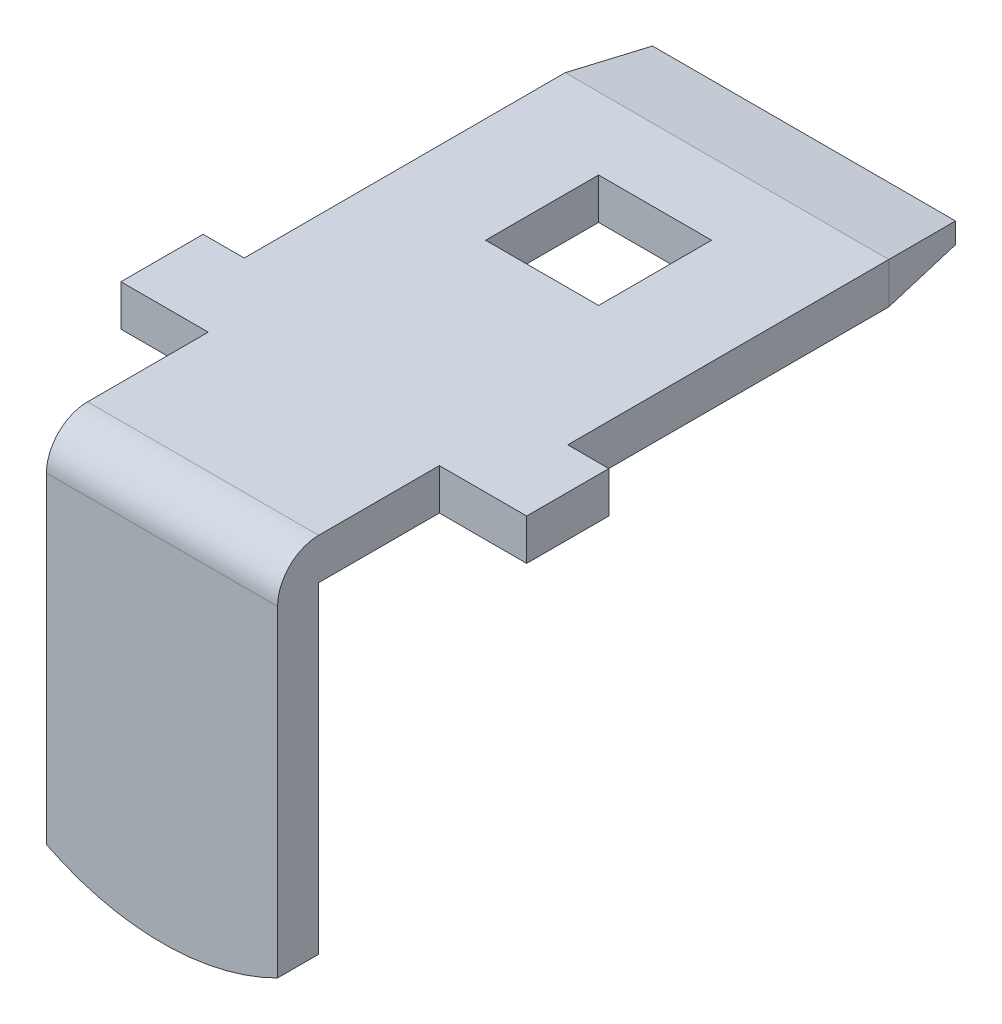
ISO-10303-21;
HEADER;
FILE_DESCRIPTION(('STEP AP214'),'2;1');
FILE_NAME('part.step','',(''),(''),'','','');
FILE_SCHEMA(('AUTOMOTIVE_DESIGN { 1 0 10303 214 1 1 1 1 }'));
ENDSEC;
DATA;
#1=APPLICATION_CONTEXT('core data for automotive mechanical design processes');
#2=APPLICATION_PROTOCOL_DEFINITION('international standard','automotive_design',2000,#1);
#3=PRODUCT_CONTEXT('',#1,'mechanical');
#4=PRODUCT('Part','Part','',(#3));
#5=PRODUCT_RELATED_PRODUCT_CATEGORY('part','',(#4));
#6=PRODUCT_DEFINITION_FORMATION('','',#4);
#7=PRODUCT_DEFINITION_CONTEXT('part definition',#1,'design');
#8=PRODUCT_DEFINITION('design','',#6,#7);
#9=PRODUCT_DEFINITION_SHAPE('','',#8);
#10=(LENGTH_UNIT() NAMED_UNIT(*) SI_UNIT(.MILLI.,.METRE.));
#11=(NAMED_UNIT(*) PLANE_ANGLE_UNIT() SI_UNIT($,.RADIAN.));
#12=(NAMED_UNIT(*) SI_UNIT($,.STERADIAN.) SOLID_ANGLE_UNIT());
#13=UNCERTAINTY_MEASURE_WITH_UNIT(LENGTH_MEASURE(1.E-05),#10,'distance_accuracy_value','');
#14=(GEOMETRIC_REPRESENTATION_CONTEXT(3) GLOBAL_UNCERTAINTY_ASSIGNED_CONTEXT((#13)) GLOBAL_UNIT_ASSIGNED_CONTEXT((#10,
#11,#12)) REPRESENTATION_CONTEXT('',''));
#15=CARTESIAN_POINT('',(0.,0.,0.));
#16=DIRECTION('',(0.,0.,1.));
#17=DIRECTION('',(1.,0.,0.));
#18=AXIS2_PLACEMENT_3D('',#15,#16,#17);
#19=CARTESIAN_POINT('',(60.,306.,-10.3000000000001));
#20=DIRECTION('',(0.,0.,-1.));
#21=DIRECTION('',(0.,1.,0.));
#22=AXIS2_PLACEMENT_3D('',#19,#20,#21);
#23=CYLINDRICAL_SURFACE('',#22,4.99999999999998);
#24=DIRECTION('',(0.,0.,-1.));
#25=VECTOR('',#24,1.);
#26=CARTESIAN_POINT('',(57.75,301.534857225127,-10.3000000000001));
#27=LINE('',#26,#25);
#28=CARTESIAN_POINT('',(57.75,301.534857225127,-10.3000000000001));
#29=VERTEX_POINT('',#28);
#30=CARTESIAN_POINT('',(57.75,301.534857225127,-11.1));
#31=VERTEX_POINT('',#30);
#32=EDGE_CURVE('E271',#29,#31,#27,.T.);
#33=ORIENTED_EDGE('',*,*,#32,.T.);
#34=CARTESIAN_POINT('',(60.,306.,-11.1));
#35=DIRECTION('',(0.,0.,-1.));
#36=DIRECTION('',(0.,1.,0.));
#37=AXIS2_PLACEMENT_3D('',#34,#35,#36);
#38=CIRCLE('',#37,4.99999999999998);
#39=CARTESIAN_POINT('',(62.25,301.534857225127,-11.1));
#40=VERTEX_POINT('',#39);
#41=EDGE_CURVE('E325',#40,#31,#38,.T.);
#42=ORIENTED_EDGE('',*,*,#41,.F.);
#43=DIRECTION('',(0.,0.,-1.));
#44=VECTOR('',#43,1.);
#45=CARTESIAN_POINT('',(62.25,301.534857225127,-10.3000000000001));
#46=LINE('',#45,#44);
#47=CARTESIAN_POINT('',(62.25,301.534857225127,-10.3000000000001));
#48=VERTEX_POINT('',#47);
#49=EDGE_CURVE('E377',#48,#40,#46,.T.);
#50=ORIENTED_EDGE('',*,*,#49,.F.);
#51=CARTESIAN_POINT('',(60.,306.,-10.3000000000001));
#52=DIRECTION('',(0.,0.,-1.));
#53=DIRECTION('',(0.,1.,0.));
#54=AXIS2_PLACEMENT_3D('',#51,#52,#53);
#55=CIRCLE('',#54,4.99999999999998);
#56=EDGE_CURVE('E307',#48,#29,#55,.T.);
#57=ORIENTED_EDGE('',*,*,#56,.T.);
#58=EDGE_LOOP('',(#33,#42,#50,#57));
#59=FACE_BOUND('',#58,.T.);
#60=ADVANCED_FACE('F34',(#59),#23,.T.);
#61=CARTESIAN_POINT('',(57.75,301.534857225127,-10.3000000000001));
#62=DIRECTION('',(-1.,0.,0.));
#63=DIRECTION('',(0.,-1.,0.));
#64=AXIS2_PLACEMENT_3D('',#61,#62,#63);
#65=PLANE('',#64);
#66=DIRECTION('',(0.,1.,0.));
#67=VECTOR('',#66,1.);
#68=CARTESIAN_POINT('',(57.75,301.534857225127,-10.3000000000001));
#69=LINE('',#68,#67);
#70=CARTESIAN_POINT('',(57.75,307.8,-10.3000000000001));
#71=VERTEX_POINT('',#70);
#72=EDGE_CURVE('E317',#29,#71,#69,.T.);
#73=ORIENTED_EDGE('',*,*,#72,.T.);
#74=CARTESIAN_POINT('',(57.75,307.8,-11.1000000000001));
#75=DIRECTION('',(-1.,0.,0.));
#76=DIRECTION('',(0.,-1.,0.));
#77=AXIS2_PLACEMENT_3D('',#74,#75,#76);
#78=CIRCLE('',#77,0.8);
#79=CARTESIAN_POINT('',(57.75,308.6,-11.1000000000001));
#80=VERTEX_POINT('',#79);
#81=EDGE_CURVE('E11',#71,#80,#78,.T.);
#82=ORIENTED_EDGE('',*,*,#81,.T.);
#83=DIRECTION('',(0.,0.,-1.));
#84=VECTOR('',#83,1.);
#85=CARTESIAN_POINT('',(57.75,308.6,-10.3000000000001));
#86=LINE('',#85,#84);
#87=CARTESIAN_POINT('',(57.75,308.6,-13.45));
#88=VERTEX_POINT('',#87);
#89=EDGE_CURVE('E303',#80,#88,#86,.T.);
#90=ORIENTED_EDGE('',*,*,#89,.T.);
#91=DIRECTION('',(0.,1.,0.));
#92=VECTOR('',#91,1.);
#93=CARTESIAN_POINT('',(57.75,308.6,-13.45));
#94=LINE('',#93,#92);
#95=CARTESIAN_POINT('',(57.75,307.8,-13.45));
#96=VERTEX_POINT('',#95);
#97=EDGE_CURVE('E242',#96,#88,#94,.T.);
#98=ORIENTED_EDGE('',*,*,#97,.F.);
#99=DIRECTION('',(0.,0.,-1.));
#100=VECTOR('',#99,1.);
#101=CARTESIAN_POINT('',(57.75,307.8,-11.1));
#102=LINE('',#101,#100);
#103=CARTESIAN_POINT('',(57.75,307.8,-11.1));
#104=VERTEX_POINT('',#103);
#105=EDGE_CURVE('E318',#104,#96,#102,.T.);
#106=ORIENTED_EDGE('',*,*,#105,.F.);
#107=DIRECTION('',(0.,1.,0.));
#108=VECTOR('',#107,1.);
#109=CARTESIAN_POINT('',(57.75,301.534857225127,-11.1));
#110=LINE('',#109,#108);
#111=EDGE_CURVE('E356',#31,#104,#110,.T.);
#112=ORIENTED_EDGE('',*,*,#111,.F.);
#113=ORIENTED_EDGE('',*,*,#32,.F.);
#114=EDGE_LOOP('',(#73,#82,#90,#98,#106,#112,#113));
#115=FACE_BOUND('',#114,.T.);
#116=ADVANCED_FACE('F374',(#115),#65,.T.);
#117=CARTESIAN_POINT('',(62.25,308.6,-10.3000000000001));
#118=DIRECTION('',(1.,0.,0.));
#119=DIRECTION('',(0.,0.,-1.));
#120=AXIS2_PLACEMENT_3D('',#117,#118,#119);
#121=PLANE('',#120);
#122=DIRECTION('',(0.,0.,-1.));
#123=VECTOR('',#122,1.);
#124=CARTESIAN_POINT('',(62.25,308.6,-10.3000000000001));
#125=LINE('',#124,#123);
#126=CARTESIAN_POINT('',(62.25,308.6,-11.1000000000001));
#127=VERTEX_POINT('',#126);
#128=CARTESIAN_POINT('',(62.25,308.6,-13.45));
#129=VERTEX_POINT('',#128);
#130=EDGE_CURVE('E306',#127,#129,#125,.T.);
#131=ORIENTED_EDGE('',*,*,#130,.F.);
#132=CARTESIAN_POINT('',(62.25,307.8,-11.1000000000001));
#133=DIRECTION('',(1.,0.,0.));
#134=DIRECTION('',(0.,0.,-1.));
#135=AXIS2_PLACEMENT_3D('',#132,#133,#134);
#136=CIRCLE('',#135,0.8);
#137=CARTESIAN_POINT('',(62.25,307.8,-10.3000000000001));
#138=VERTEX_POINT('',#137);
#139=EDGE_CURVE('E56',#127,#138,#136,.T.);
#140=ORIENTED_EDGE('',*,*,#139,.T.);
#141=DIRECTION('',(0.,-1.,0.));
#142=VECTOR('',#141,1.);
#143=CARTESIAN_POINT('',(62.25,308.6,-10.3000000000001));
#144=LINE('',#143,#142);
#145=EDGE_CURVE('E380',#138,#48,#144,.T.);
#146=ORIENTED_EDGE('',*,*,#145,.T.);
#147=ORIENTED_EDGE('',*,*,#49,.T.);
#148=DIRECTION('',(0.,-1.,0.));
#149=VECTOR('',#148,1.);
#150=CARTESIAN_POINT('',(62.25,307.8,-11.1));
#151=LINE('',#150,#149);
#152=CARTESIAN_POINT('',(62.25,307.8,-11.1));
#153=VERTEX_POINT('',#152);
#154=EDGE_CURVE('E362',#153,#40,#151,.T.);
#155=ORIENTED_EDGE('',*,*,#154,.F.);
#156=DIRECTION('',(0.,0.,-1.));
#157=VECTOR('',#156,1.);
#158=CARTESIAN_POINT('',(62.25,307.8,-11.1));
#159=LINE('',#158,#157);
#160=CARTESIAN_POINT('',(62.25,307.8,-13.45));
#161=VERTEX_POINT('',#160);
#162=EDGE_CURVE('E314',#153,#161,#159,.T.);
#163=ORIENTED_EDGE('',*,*,#162,.T.);
#164=DIRECTION('',(0.,-1.,0.));
#165=VECTOR('',#164,1.);
#166=CARTESIAN_POINT('',(62.25,307.8,-13.45));
#167=LINE('',#166,#165);
#168=EDGE_CURVE('E319',#129,#161,#167,.T.);
#169=ORIENTED_EDGE('',*,*,#168,.F.);
#170=EDGE_LOOP('',(#131,#140,#146,#147,#155,#163,#169));
#171=FACE_BOUND('',#170,.T.);
#172=ADVANCED_FACE('F387',(#171),#121,.T.);
#173=CARTESIAN_POINT('',(57.75,308.6,-10.3000000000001));
#174=DIRECTION('',(0.,1.,0.));
#175=DIRECTION('',(0.,0.,1.));
#176=AXIS2_PLACEMENT_3D('',#173,#174,#175);
#177=PLANE('',#176);
#178=DIRECTION('',(1.,0.,0.));
#179=VECTOR('',#178,1.);
#180=CARTESIAN_POINT('',(57.75,308.6,-17.7));
#181=LINE('',#180,#179);
#182=CARTESIAN_POINT('',(58.9,308.6,-17.7));
#183=VERTEX_POINT('',#182);
#184=CARTESIAN_POINT('',(61.1,308.6,-17.7));
#185=VERTEX_POINT('',#184);
#186=EDGE_CURVE('E216',#183,#185,#181,.T.);
#187=ORIENTED_EDGE('',*,*,#186,.F.);
#188=DIRECTION('',(0.,0.,1.));
#189=VECTOR('',#188,1.);
#190=CARTESIAN_POINT('',(58.9,308.6,-10.3000000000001));
#191=LINE('',#190,#189);
#192=CARTESIAN_POINT('',(58.9,308.6,-19.9));
#193=VERTEX_POINT('',#192);
#194=EDGE_CURVE('E209',#193,#183,#191,.T.);
#195=ORIENTED_EDGE('',*,*,#194,.F.);
#196=DIRECTION('',(-1.,0.,0.));
#197=VECTOR('',#196,1.);
#198=CARTESIAN_POINT('',(57.75,308.6,-19.9));
#199=LINE('',#198,#197);
#200=CARTESIAN_POINT('',(61.1,308.6,-19.9));
#201=VERTEX_POINT('',#200);
#202=EDGE_CURVE('E184',#201,#193,#199,.T.);
#203=ORIENTED_EDGE('',*,*,#202,.F.);
#204=DIRECTION('',(0.,0.,-1.));
#205=VECTOR('',#204,1.);
#206=CARTESIAN_POINT('',(61.1000000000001,308.6,-10.3000000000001));
#207=LINE('',#206,#205);
#208=EDGE_CURVE('E214',#185,#201,#207,.T.);
#209=ORIENTED_EDGE('',*,*,#208,.F.);
#210=EDGE_LOOP('',(#187,#195,#203,#209));
#211=FACE_BOUND('',#210,.T.);
#212=ORIENTED_EDGE('',*,*,#89,.F.);
#213=DIRECTION('',(1.,0.,0.));
#214=VECTOR('',#213,1.);
#215=CARTESIAN_POINT('',(62.25,308.6,-11.1000000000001));
#216=LINE('',#215,#214);
#217=EDGE_CURVE('E292',#80,#127,#216,.T.);
#218=ORIENTED_EDGE('',*,*,#217,.T.);
#219=ORIENTED_EDGE('',*,*,#130,.T.);
#220=DIRECTION('',(-1.,0.,0.));
#221=VECTOR('',#220,1.);
#222=CARTESIAN_POINT('',(63.95,308.6,-13.45));
#223=LINE('',#222,#221);
#224=CARTESIAN_POINT('',(63.95,308.6,-13.45));
#225=VERTEX_POINT('',#224);
#226=EDGE_CURVE('E360',#225,#129,#223,.T.);
#227=ORIENTED_EDGE('',*,*,#226,.F.);
#228=DIRECTION('',(0.,0.,1.));
#229=VECTOR('',#228,1.);
#230=CARTESIAN_POINT('',(63.95,308.6,-13.45));
#231=LINE('',#230,#229);
#232=CARTESIAN_POINT('',(63.95,308.6,-15.0500000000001));
#233=VERTEX_POINT('',#232);
#234=EDGE_CURVE('E254',#233,#225,#231,.T.);
#235=ORIENTED_EDGE('',*,*,#234,.F.);
#236=DIRECTION('',(1.,0.,0.));
#237=VECTOR('',#236,1.);
#238=CARTESIAN_POINT('',(57.75,308.6,-15.0500000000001));
#239=LINE('',#238,#237);
#240=CARTESIAN_POINT('',(63.15,308.6,-15.0500000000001));
#241=VERTEX_POINT('',#240);
#242=EDGE_CURVE('E238',#241,#233,#239,.T.);
#243=ORIENTED_EDGE('',*,*,#242,.F.);
#244=DIRECTION('',(0.,0.,1.));
#245=VECTOR('',#244,1.);
#246=CARTESIAN_POINT('',(63.15,308.6,-10.3000000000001));
#247=LINE('',#246,#245);
#248=CARTESIAN_POINT('',(63.15,308.6,-21.3000000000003));
#249=VERTEX_POINT('',#248);
#250=EDGE_CURVE('E240',#249,#241,#247,.T.);
#251=ORIENTED_EDGE('',*,*,#250,.F.);
#252=DIRECTION('',(-1.,0.,0.));
#253=VECTOR('',#252,1.);
#254=CARTESIAN_POINT('',(57.75,308.6,-21.3000000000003));
#255=LINE('',#254,#253);
#256=CARTESIAN_POINT('',(56.85,308.6,-21.3000000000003));
#257=VERTEX_POINT('',#256);
#258=EDGE_CURVE('E290',#249,#257,#255,.T.);
#259=ORIENTED_EDGE('',*,*,#258,.T.);
#260=DIRECTION('',(0.,0.,-1.));
#261=VECTOR('',#260,1.);
#262=CARTESIAN_POINT('',(56.85,308.6,-10.3000000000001));
#263=LINE('',#262,#261);
#264=CARTESIAN_POINT('',(56.85,308.6,-15.05));
#265=VERTEX_POINT('',#264);
#266=EDGE_CURVE('E227',#265,#257,#263,.T.);
#267=ORIENTED_EDGE('',*,*,#266,.F.);
#268=DIRECTION('',(1.,0.,0.));
#269=VECTOR('',#268,1.);
#270=CARTESIAN_POINT('',(57.7500000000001,308.6,-15.05));
#271=LINE('',#270,#269);
#272=CARTESIAN_POINT('',(56.05,308.6,-15.0500000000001));
#273=VERTEX_POINT('',#272);
#274=EDGE_CURVE('E225',#273,#265,#271,.T.);
#275=ORIENTED_EDGE('',*,*,#274,.F.);
#276=DIRECTION('',(0.,0.,-1.));
#277=VECTOR('',#276,1.);
#278=CARTESIAN_POINT('',(56.05,308.6,-22.8000000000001));
#279=LINE('',#278,#277);
#280=CARTESIAN_POINT('',(56.05,308.6,-13.45));
#281=VERTEX_POINT('',#280);
#282=EDGE_CURVE('E246',#281,#273,#279,.T.);
#283=ORIENTED_EDGE('',*,*,#282,.F.);
#284=DIRECTION('',(1.,0.,0.));
#285=VECTOR('',#284,1.);
#286=CARTESIAN_POINT('',(56.05,308.6,-13.45));
#287=LINE('',#286,#285);
#288=EDGE_CURVE('E264',#281,#88,#287,.T.);
#289=ORIENTED_EDGE('',*,*,#288,.T.);
#290=EDGE_LOOP('',(#212,#218,#219,#227,#235,#243,#251,#259,#267,#275,#283,#289));
#291=FACE_BOUND('',#290,.T.);
#292=ADVANCED_FACE('F386',(#211,#291),#177,.T.);
#293=CARTESIAN_POINT('',(60.,306.,-10.3000000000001));
#294=DIRECTION('',(0.,0.,-1.));
#295=DIRECTION('',(0.,1.,0.));
#296=AXIS2_PLACEMENT_3D('',#293,#294,#295);
#297=PLANE('',#296);
#298=ORIENTED_EDGE('',*,*,#145,.F.);
#299=DIRECTION('',(1.,0.,0.));
#300=VECTOR('',#299,1.);
#301=CARTESIAN_POINT('',(57.75,307.8,-10.3000000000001));
#302=LINE('',#301,#300);
#303=EDGE_CURVE('E42',#138,#71,#302,.F.);
#304=ORIENTED_EDGE('',*,*,#303,.T.);
#305=ORIENTED_EDGE('',*,*,#72,.F.);
#306=ORIENTED_EDGE('',*,*,#56,.F.);
#307=EDGE_LOOP('',(#298,#304,#305,#306));
#308=FACE_BOUND('',#307,.T.);
#309=ADVANCED_FACE('F438',(#308),#297,.F.);
#310=CARTESIAN_POINT('',(60.,306.,-22.8000000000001));
#311=DIRECTION('',(0.,0.,-1.));
#312=DIRECTION('',(0.,1.,0.));
#313=AXIS2_PLACEMENT_3D('',#310,#311,#312);
#314=PLANE('',#313);
#315=DIRECTION('',(0.,-1.,0.));
#316=VECTOR('',#315,1.);
#317=CARTESIAN_POINT('',(62.95,307.8,-22.8000000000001));
#318=LINE('',#317,#316);
#319=CARTESIAN_POINT('',(62.95,308.4,-22.8000000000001));
#320=VERTEX_POINT('',#319);
#321=CARTESIAN_POINT('',(62.95,308.,-22.8000000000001));
#322=VERTEX_POINT('',#321);
#323=EDGE_CURVE('E281',#320,#322,#318,.T.);
#324=ORIENTED_EDGE('',*,*,#323,.T.);
#325=DIRECTION('',(-1.,0.,0.));
#326=VECTOR('',#325,1.);
#327=CARTESIAN_POINT('',(56.85,308.,-22.8000000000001));
#328=LINE('',#327,#326);
#329=CARTESIAN_POINT('',(57.05,308.,-22.8000000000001));
#330=VERTEX_POINT('',#329);
#331=EDGE_CURVE('E283',#322,#330,#328,.T.);
#332=ORIENTED_EDGE('',*,*,#331,.T.);
#333=DIRECTION('',(0.,1.,0.));
#334=VECTOR('',#333,1.);
#335=CARTESIAN_POINT('',(57.05,308.6,-22.8000000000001));
#336=LINE('',#335,#334);
#337=CARTESIAN_POINT('',(57.05,308.4,-22.8000000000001));
#338=VERTEX_POINT('',#337);
#339=EDGE_CURVE('E279',#330,#338,#336,.T.);
#340=ORIENTED_EDGE('',*,*,#339,.T.);
#341=DIRECTION('',(1.,0.,0.));
#342=VECTOR('',#341,1.);
#343=CARTESIAN_POINT('',(60.,308.4,-22.8000000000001));
#344=LINE('',#343,#342);
#345=EDGE_CURVE('E277',#338,#320,#344,.T.);
#346=ORIENTED_EDGE('',*,*,#345,.T.);
#347=EDGE_LOOP('',(#324,#332,#340,#346));
#348=FACE_BOUND('',#347,.T.);
#349=ADVANCED_FACE('F418',(#348),#314,.T.);
#350=CARTESIAN_POINT('',(57.75,307.8,-11.1));
#351=DIRECTION('',(0.,1.,0.));
#352=DIRECTION('',(0.,0.,1.));
#353=AXIS2_PLACEMENT_3D('',#350,#351,#352);
#354=PLANE('',#353);
#355=DIRECTION('',(0.,0.,-1.));
#356=VECTOR('',#355,1.);
#357=CARTESIAN_POINT('',(58.9,307.8,-17.7));
#358=LINE('',#357,#356);
#359=CARTESIAN_POINT('',(58.9,307.8,-17.7));
#360=VERTEX_POINT('',#359);
#361=CARTESIAN_POINT('',(58.9,307.8,-19.9));
#362=VERTEX_POINT('',#361);
#363=EDGE_CURVE('E192',#360,#362,#358,.T.);
#364=ORIENTED_EDGE('',*,*,#363,.F.);
#365=DIRECTION('',(-1.,0.,0.));
#366=VECTOR('',#365,1.);
#367=CARTESIAN_POINT('',(61.1,307.8,-17.7));
#368=LINE('',#367,#366);
#369=CARTESIAN_POINT('',(61.1,307.8,-17.7));
#370=VERTEX_POINT('',#369);
#371=EDGE_CURVE('E197',#370,#360,#368,.T.);
#372=ORIENTED_EDGE('',*,*,#371,.F.);
#373=DIRECTION('',(0.,0.,1.));
#374=VECTOR('',#373,1.);
#375=CARTESIAN_POINT('',(61.1,307.8,-19.9));
#376=LINE('',#375,#374);
#377=CARTESIAN_POINT('',(61.1,307.8,-19.9));
#378=VERTEX_POINT('',#377);
#379=EDGE_CURVE('E202',#378,#370,#376,.T.);
#380=ORIENTED_EDGE('',*,*,#379,.F.);
#381=DIRECTION('',(1.,0.,0.));
#382=VECTOR('',#381,1.);
#383=CARTESIAN_POINT('',(58.9,307.8,-19.9));
#384=LINE('',#383,#382);
#385=EDGE_CURVE('E181',#362,#378,#384,.T.);
#386=ORIENTED_EDGE('',*,*,#385,.F.);
#387=EDGE_LOOP('',(#364,#372,#380,#386));
#388=FACE_BOUND('',#387,.T.);
#389=DIRECTION('',(0.,0.,1.));
#390=VECTOR('',#389,1.);
#391=CARTESIAN_POINT('',(56.85,307.8,-22.8000000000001));
#392=LINE('',#391,#390);
#393=CARTESIAN_POINT('',(56.85,307.8,-21.3000000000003));
#394=VERTEX_POINT('',#393);
#395=CARTESIAN_POINT('',(56.85,307.8,-15.05));
#396=VERTEX_POINT('',#395);
#397=EDGE_CURVE('E218',#394,#396,#392,.T.);
#398=ORIENTED_EDGE('',*,*,#397,.F.);
#399=DIRECTION('',(1.,0.,0.));
#400=VECTOR('',#399,1.);
#401=CARTESIAN_POINT('',(63.15,307.8,-21.3000000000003));
#402=LINE('',#401,#400);
#403=CARTESIAN_POINT('',(63.15,307.8,-21.3000000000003));
#404=VERTEX_POINT('',#403);
#405=EDGE_CURVE('E274',#394,#404,#402,.T.);
#406=ORIENTED_EDGE('',*,*,#405,.T.);
#407=DIRECTION('',(0.,0.,-1.));
#408=VECTOR('',#407,1.);
#409=CARTESIAN_POINT('',(63.15,307.8,-15.0500000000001));
#410=LINE('',#409,#408);
#411=CARTESIAN_POINT('',(63.15,307.8,-15.0500000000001));
#412=VERTEX_POINT('',#411);
#413=EDGE_CURVE('E233',#412,#404,#410,.T.);
#414=ORIENTED_EDGE('',*,*,#413,.F.);
#415=DIRECTION('',(-1.,0.,0.));
#416=VECTOR('',#415,1.);
#417=CARTESIAN_POINT('',(63.95,307.8,-15.0500000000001));
#418=LINE('',#417,#416);
#419=CARTESIAN_POINT('',(63.95,307.8,-15.0500000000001));
#420=VERTEX_POINT('',#419);
#421=EDGE_CURVE('E230',#420,#412,#418,.T.);
#422=ORIENTED_EDGE('',*,*,#421,.F.);
#423=DIRECTION('',(0.,0.,-1.));
#424=VECTOR('',#423,1.);
#425=CARTESIAN_POINT('',(63.95,307.8,-22.8000000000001));
#426=LINE('',#425,#424);
#427=CARTESIAN_POINT('',(63.95,307.8,-13.45));
#428=VERTEX_POINT('',#427);
#429=EDGE_CURVE('E349',#428,#420,#426,.T.);
#430=ORIENTED_EDGE('',*,*,#429,.F.);
#431=DIRECTION('',(-1.,0.,0.));
#432=VECTOR('',#431,1.);
#433=CARTESIAN_POINT('',(63.95,307.8,-13.45));
#434=LINE('',#433,#432);
#435=EDGE_CURVE('E352',#428,#161,#434,.T.);
#436=ORIENTED_EDGE('',*,*,#435,.T.);
#437=ORIENTED_EDGE('',*,*,#162,.F.);
#438=DIRECTION('',(1.,0.,0.));
#439=VECTOR('',#438,1.);
#440=CARTESIAN_POINT('',(57.75,307.8,-11.1));
#441=LINE('',#440,#439);
#442=EDGE_CURVE('E359',#104,#153,#441,.T.);
#443=ORIENTED_EDGE('',*,*,#442,.F.);
#444=ORIENTED_EDGE('',*,*,#105,.T.);
#445=DIRECTION('',(1.,0.,0.));
#446=VECTOR('',#445,1.);
#447=CARTESIAN_POINT('',(56.05,307.8,-13.45));
#448=LINE('',#447,#446);
#449=CARTESIAN_POINT('',(56.05,307.8,-13.45));
#450=VERTEX_POINT('',#449);
#451=EDGE_CURVE('E251',#450,#96,#448,.T.);
#452=ORIENTED_EDGE('',*,*,#451,.F.);
#453=DIRECTION('',(0.,0.,1.));
#454=VECTOR('',#453,1.);
#455=CARTESIAN_POINT('',(56.05,307.8,-13.45));
#456=LINE('',#455,#454);
#457=CARTESIAN_POINT('',(56.05,307.8,-15.05));
#458=VERTEX_POINT('',#457);
#459=EDGE_CURVE('E249',#458,#450,#456,.T.);
#460=ORIENTED_EDGE('',*,*,#459,.F.);
#461=DIRECTION('',(-1.,0.,0.));
#462=VECTOR('',#461,1.);
#463=CARTESIAN_POINT('',(56.85,307.8,-15.05));
#464=LINE('',#463,#462);
#465=EDGE_CURVE('E220',#396,#458,#464,.T.);
#466=ORIENTED_EDGE('',*,*,#465,.F.);
#467=EDGE_LOOP('',(#398,#406,#414,#422,#430,#436,#437,#443,#444,#452,#460,#466));
#468=FACE_BOUND('',#467,.T.);
#469=ADVANCED_FACE('F199',(#388,#468),#354,.F.);
#470=CARTESIAN_POINT('',(60.,306.,-11.1));
#471=DIRECTION('',(0.,0.,-1.));
#472=DIRECTION('',(0.,1.,0.));
#473=AXIS2_PLACEMENT_3D('',#470,#471,#472);
#474=PLANE('',#473);
#475=ORIENTED_EDGE('',*,*,#111,.T.);
#476=ORIENTED_EDGE('',*,*,#442,.T.);
#477=ORIENTED_EDGE('',*,*,#154,.T.);
#478=ORIENTED_EDGE('',*,*,#41,.T.);
#479=EDGE_LOOP('',(#475,#476,#477,#478));
#480=FACE_BOUND('',#479,.T.);
#481=ADVANCED_FACE('F367',(#480),#474,.T.);
#482=CARTESIAN_POINT('',(63.95,307.8,-13.45));
#483=DIRECTION('',(0.,0.,-1.));
#484=DIRECTION('',(-1.,0.,0.));
#485=AXIS2_PLACEMENT_3D('',#482,#483,#484);
#486=PLANE('',#485);
#487=ORIENTED_EDGE('',*,*,#168,.T.);
#488=ORIENTED_EDGE('',*,*,#435,.F.);
#489=DIRECTION('',(0.,-1.,0.));
#490=VECTOR('',#489,1.);
#491=CARTESIAN_POINT('',(63.95,307.8,-13.45));
#492=LINE('',#491,#490);
#493=EDGE_CURVE('E345',#225,#428,#492,.T.);
#494=ORIENTED_EDGE('',*,*,#493,.F.);
#495=ORIENTED_EDGE('',*,*,#226,.T.);
#496=EDGE_LOOP('',(#487,#488,#494,#495));
#497=FACE_BOUND('',#496,.T.);
#498=ADVANCED_FACE('F388',(#497),#486,.F.);
#499=CARTESIAN_POINT('',(63.95,307.8,-22.8000000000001));
#500=DIRECTION('',(-1.,0.,0.));
#501=DIRECTION('',(0.,0.,1.));
#502=AXIS2_PLACEMENT_3D('',#499,#500,#501);
#503=PLANE('',#502);
#504=ORIENTED_EDGE('',*,*,#429,.T.);
#505=DIRECTION('',(0.,1.,0.));
#506=VECTOR('',#505,1.);
#507=CARTESIAN_POINT('',(63.95,307.8,-15.0500000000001));
#508=LINE('',#507,#506);
#509=EDGE_CURVE('E267',#420,#233,#508,.T.);
#510=ORIENTED_EDGE('',*,*,#509,.T.);
#511=ORIENTED_EDGE('',*,*,#234,.T.);
#512=ORIENTED_EDGE('',*,*,#493,.T.);
#513=EDGE_LOOP('',(#504,#510,#511,#512));
#514=FACE_BOUND('',#513,.T.);
#515=ADVANCED_FACE('F395',(#514),#503,.F.);
#516=CARTESIAN_POINT('',(56.05,308.6,-13.45));
#517=DIRECTION('',(0.,0.,-1.));
#518=DIRECTION('',(-1.,0.,0.));
#519=AXIS2_PLACEMENT_3D('',#516,#517,#518);
#520=PLANE('',#519);
#521=ORIENTED_EDGE('',*,*,#97,.T.);
#522=ORIENTED_EDGE('',*,*,#288,.F.);
#523=DIRECTION('',(0.,1.,0.));
#524=VECTOR('',#523,1.);
#525=CARTESIAN_POINT('',(56.05,308.6,-13.45));
#526=LINE('',#525,#524);
#527=EDGE_CURVE('E243',#450,#281,#526,.T.);
#528=ORIENTED_EDGE('',*,*,#527,.F.);
#529=ORIENTED_EDGE('',*,*,#451,.T.);
#530=EDGE_LOOP('',(#521,#522,#528,#529));
#531=FACE_BOUND('',#530,.T.);
#532=ADVANCED_FACE('F437',(#531),#520,.F.);
#533=CARTESIAN_POINT('',(56.05,307.8,-13.45));
#534=DIRECTION('',(1.,0.,0.));
#535=DIRECTION('',(0.,0.,-1.));
#536=AXIS2_PLACEMENT_3D('',#533,#534,#535);
#537=PLANE('',#536);
#538=ORIENTED_EDGE('',*,*,#282,.T.);
#539=DIRECTION('',(0.,-1.,0.));
#540=VECTOR('',#539,1.);
#541=CARTESIAN_POINT('',(56.05,307.8,-15.0500000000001));
#542=LINE('',#541,#540);
#543=EDGE_CURVE('E270',#273,#458,#542,.T.);
#544=ORIENTED_EDGE('',*,*,#543,.T.);
#545=ORIENTED_EDGE('',*,*,#459,.T.);
#546=ORIENTED_EDGE('',*,*,#527,.T.);
#547=EDGE_LOOP('',(#538,#544,#545,#546));
#548=FACE_BOUND('',#547,.T.);
#549=ADVANCED_FACE('F435',(#548),#537,.F.);
#550=CARTESIAN_POINT('',(63.95,308.60005,-15.0500000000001));
#551=DIRECTION('',(0.,0.,1.));
#552=DIRECTION('',(1.,0.,0.));
#553=AXIS2_PLACEMENT_3D('',#550,#551,#552);
#554=PLANE('',#553);
#555=ORIENTED_EDGE('',*,*,#242,.T.);
#556=ORIENTED_EDGE('',*,*,#509,.F.);
#557=ORIENTED_EDGE('',*,*,#421,.T.);
#558=DIRECTION('',(0.,-1.,0.));
#559=VECTOR('',#558,1.);
#560=CARTESIAN_POINT('',(63.15,308.60005,-15.0500000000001));
#561=LINE('',#560,#559);
#562=EDGE_CURVE('E236',#241,#412,#561,.T.);
#563=ORIENTED_EDGE('',*,*,#562,.F.);
#564=EDGE_LOOP('',(#555,#556,#557,#563));
#565=FACE_BOUND('',#564,.T.);
#566=ADVANCED_FACE('F401',(#565),#554,.F.);
#567=CARTESIAN_POINT('',(63.15,308.60005,-15.0500000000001));
#568=DIRECTION('',(-1.,0.,0.));
#569=DIRECTION('',(0.,0.,1.));
#570=AXIS2_PLACEMENT_3D('',#567,#568,#569);
#571=PLANE('',#570);
#572=ORIENTED_EDGE('',*,*,#413,.T.);
#573=DIRECTION('',(0.,1.,0.));
#574=VECTOR('',#573,1.);
#575=CARTESIAN_POINT('',(63.15,308.6,-21.3000000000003));
#576=LINE('',#575,#574);
#577=EDGE_CURVE('E286',#404,#249,#576,.T.);
#578=ORIENTED_EDGE('',*,*,#577,.T.);
#579=ORIENTED_EDGE('',*,*,#250,.T.);
#580=ORIENTED_EDGE('',*,*,#562,.T.);
#581=EDGE_LOOP('',(#572,#578,#579,#580));
#582=FACE_BOUND('',#581,.T.);
#583=ADVANCED_FACE('F403',(#582),#571,.F.);
#584=CARTESIAN_POINT('',(56.85,308.60005,-22.8000000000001));
#585=DIRECTION('',(1.,0.,0.));
#586=DIRECTION('',(0.,0.,-1.));
#587=AXIS2_PLACEMENT_3D('',#584,#585,#586);
#588=PLANE('',#587);
#589=ORIENTED_EDGE('',*,*,#266,.T.);
#590=DIRECTION('',(0.,-1.,0.));
#591=VECTOR('',#590,1.);
#592=CARTESIAN_POINT('',(56.85,307.8,-21.3000000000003));
#593=LINE('',#592,#591);
#594=EDGE_CURVE('E288',#257,#394,#593,.T.);
#595=ORIENTED_EDGE('',*,*,#594,.T.);
#596=ORIENTED_EDGE('',*,*,#397,.T.);
#597=DIRECTION('',(0.,-1.,0.));
#598=VECTOR('',#597,1.);
#599=CARTESIAN_POINT('',(56.85,308.60005,-15.05));
#600=LINE('',#599,#598);
#601=EDGE_CURVE('E222',#265,#396,#600,.T.);
#602=ORIENTED_EDGE('',*,*,#601,.F.);
#603=EDGE_LOOP('',(#589,#595,#596,#602));
#604=FACE_BOUND('',#603,.T.);
#605=ADVANCED_FACE('F428',(#604),#588,.F.);
#606=CARTESIAN_POINT('',(56.85,308.60005,-15.05));
#607=DIRECTION('',(0.,0.,1.));
#608=DIRECTION('',(1.,0.,0.));
#609=AXIS2_PLACEMENT_3D('',#606,#607,#608);
#610=PLANE('',#609);
#611=ORIENTED_EDGE('',*,*,#274,.T.);
#612=ORIENTED_EDGE('',*,*,#601,.T.);
#613=ORIENTED_EDGE('',*,*,#465,.T.);
#614=ORIENTED_EDGE('',*,*,#543,.F.);
#615=EDGE_LOOP('',(#611,#612,#613,#614));
#616=FACE_BOUND('',#615,.T.);
#617=ADVANCED_FACE('F430',(#616),#610,.F.);
#618=CARTESIAN_POINT('',(61.1,308.60005,-17.7));
#619=DIRECTION('',(0.,0.,1.));
#620=DIRECTION('',(0.,-1.,0.));
#621=AXIS2_PLACEMENT_3D('',#618,#619,#620);
#622=PLANE('',#621);
#623=ORIENTED_EDGE('',*,*,#186,.T.);
#624=DIRECTION('',(0.,-1.,0.));
#625=VECTOR('',#624,1.);
#626=CARTESIAN_POINT('',(61.1,308.60005,-17.7));
#627=LINE('',#626,#625);
#628=EDGE_CURVE('E207',#185,#370,#627,.T.);
#629=ORIENTED_EDGE('',*,*,#628,.T.);
#630=ORIENTED_EDGE('',*,*,#371,.T.);
#631=DIRECTION('',(0.,-1.,0.));
#632=VECTOR('',#631,1.);
#633=CARTESIAN_POINT('',(58.9,308.60005,-17.7));
#634=LINE('',#633,#632);
#635=EDGE_CURVE('E188',#183,#360,#634,.T.);
#636=ORIENTED_EDGE('',*,*,#635,.F.);
#637=EDGE_LOOP('',(#623,#629,#630,#636));
#638=FACE_BOUND('',#637,.T.);
#639=ADVANCED_FACE('F477',(#638),#622,.F.);
#640=CARTESIAN_POINT('',(61.1,308.60005,-19.9));
#641=DIRECTION('',(1.,0.,0.));
#642=DIRECTION('',(0.,0.,-1.));
#643=AXIS2_PLACEMENT_3D('',#640,#641,#642);
#644=PLANE('',#643);
#645=ORIENTED_EDGE('',*,*,#208,.T.);
#646=DIRECTION('',(0.,-1.,0.));
#647=VECTOR('',#646,1.);
#648=CARTESIAN_POINT('',(61.1,308.60005,-19.9));
#649=LINE('',#648,#647);
#650=EDGE_CURVE('E187',#201,#378,#649,.T.);
#651=ORIENTED_EDGE('',*,*,#650,.T.);
#652=ORIENTED_EDGE('',*,*,#379,.T.);
#653=ORIENTED_EDGE('',*,*,#628,.F.);
#654=EDGE_LOOP('',(#645,#651,#652,#653));
#655=FACE_BOUND('',#654,.T.);
#656=ADVANCED_FACE('F473',(#655),#644,.F.);
#657=CARTESIAN_POINT('',(58.9,308.60005,-19.9));
#658=DIRECTION('',(0.,0.,-1.));
#659=DIRECTION('',(0.,1.,0.));
#660=AXIS2_PLACEMENT_3D('',#657,#658,#659);
#661=PLANE('',#660);
#662=ORIENTED_EDGE('',*,*,#202,.T.);
#663=DIRECTION('',(0.,-1.,0.));
#664=VECTOR('',#663,1.);
#665=CARTESIAN_POINT('',(58.9,308.60005,-19.9));
#666=LINE('',#665,#664);
#667=EDGE_CURVE('E176',#193,#362,#666,.T.);
#668=ORIENTED_EDGE('',*,*,#667,.T.);
#669=ORIENTED_EDGE('',*,*,#385,.T.);
#670=ORIENTED_EDGE('',*,*,#650,.F.);
#671=EDGE_LOOP('',(#662,#668,#669,#670));
#672=FACE_BOUND('',#671,.T.);
#673=ADVANCED_FACE('F178',(#672),#661,.F.);
#674=CARTESIAN_POINT('',(58.9,308.60005,-17.7));
#675=DIRECTION('',(-1.,0.,0.));
#676=DIRECTION('',(0.,0.,1.));
#677=AXIS2_PLACEMENT_3D('',#674,#675,#676);
#678=PLANE('',#677);
#679=ORIENTED_EDGE('',*,*,#194,.T.);
#680=ORIENTED_EDGE('',*,*,#635,.T.);
#681=ORIENTED_EDGE('',*,*,#363,.T.);
#682=ORIENTED_EDGE('',*,*,#667,.F.);
#683=EDGE_LOOP('',(#679,#680,#681,#682));
#684=FACE_BOUND('',#683,.T.);
#685=ADVANCED_FACE('F193',(#684),#678,.F.);
#686=CARTESIAN_POINT('',(60.,308.4,-22.8000000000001));
#687=DIRECTION('',(0.,-0.991227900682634,0.132163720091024));
#688=DIRECTION('',(0.,-0.132163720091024,-0.991227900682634));
#689=AXIS2_PLACEMENT_3D('',#686,#687,#688);
#690=PLANE('',#689);
#691=DIRECTION('',(0.131024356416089,0.13102435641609,0.982682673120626));
#692=VECTOR('',#691,1.);
#693=CARTESIAN_POINT('',(62.899356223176,308.349356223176,-23.1798283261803));
#694=LINE('',#693,#692);
#695=EDGE_CURVE('E297',#320,#249,#694,.T.);
#696=ORIENTED_EDGE('',*,*,#695,.F.);
#697=ORIENTED_EDGE('',*,*,#345,.F.);
#698=DIRECTION('',(0.131024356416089,-0.13102435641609,-0.982682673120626));
#699=VECTOR('',#698,1.);
#700=CARTESIAN_POINT('',(57.1006437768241,308.349356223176,-23.1798283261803));
#701=LINE('',#700,#699);
#702=EDGE_CURVE('E300',#257,#338,#701,.T.);
#703=ORIENTED_EDGE('',*,*,#702,.F.);
#704=ORIENTED_EDGE('',*,*,#258,.F.);
#705=EDGE_LOOP('',(#696,#697,#703,#704));
#706=FACE_BOUND('',#705,.T.);
#707=ADVANCED_FACE('F422',(#706),#690,.F.);
#708=CARTESIAN_POINT('',(56.85,308.60005,-21.3000000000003));
#709=DIRECTION('',(-0.991227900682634,0.,-0.132163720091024));
#710=DIRECTION('',(-0.132163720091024,0.,0.991227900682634));
#711=AXIS2_PLACEMENT_3D('',#708,#709,#710);
#712=PLANE('',#711);
#713=ORIENTED_EDGE('',*,*,#702,.T.);
#714=ORIENTED_EDGE('',*,*,#339,.F.);
#715=DIRECTION('',(-0.131024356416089,-0.131024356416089,0.982682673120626));
#716=VECTOR('',#715,1.);
#717=CARTESIAN_POINT('',(56.8637347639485,307.813734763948,-21.403010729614));
#718=LINE('',#717,#716);
#719=EDGE_CURVE('E295',#394,#330,#718,.F.);
#720=ORIENTED_EDGE('',*,*,#719,.F.);
#721=ORIENTED_EDGE('',*,*,#594,.F.);
#722=EDGE_LOOP('',(#713,#714,#720,#721));
#723=FACE_BOUND('',#722,.T.);
#724=ADVANCED_FACE('F462',(#723),#712,.T.);
#725=CARTESIAN_POINT('',(62.95,306.,-22.8000000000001));
#726=DIRECTION('',(0.991227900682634,0.,-0.132163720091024));
#727=DIRECTION('',(-0.132163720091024,0.,-0.991227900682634));
#728=AXIS2_PLACEMENT_3D('',#725,#726,#727);
#729=PLANE('',#728);
#730=ORIENTED_EDGE('',*,*,#695,.T.);
#731=ORIENTED_EDGE('',*,*,#577,.F.);
#732=DIRECTION('',(-0.131024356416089,0.131024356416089,-0.982682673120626));
#733=VECTOR('',#732,1.);
#734=CARTESIAN_POINT('',(62.9843347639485,307.965665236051,-22.5424892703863));
#735=LINE('',#734,#733);
#736=EDGE_CURVE('E293',#322,#404,#735,.F.);
#737=ORIENTED_EDGE('',*,*,#736,.F.);
#738=ORIENTED_EDGE('',*,*,#323,.F.);
#739=EDGE_LOOP('',(#730,#731,#737,#738));
#740=FACE_BOUND('',#739,.T.);
#741=ADVANCED_FACE('F407',(#740),#729,.T.);
#742=CARTESIAN_POINT('',(57.75,307.8,-21.3000000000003));
#743=DIRECTION('',(0.,-0.991227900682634,-0.132163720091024));
#744=DIRECTION('',(0.,0.132163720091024,-0.991227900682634));
#745=AXIS2_PLACEMENT_3D('',#742,#743,#744);
#746=PLANE('',#745);
#747=ORIENTED_EDGE('',*,*,#719,.T.);
#748=ORIENTED_EDGE('',*,*,#331,.F.);
#749=ORIENTED_EDGE('',*,*,#736,.T.);
#750=ORIENTED_EDGE('',*,*,#405,.F.);
#751=EDGE_LOOP('',(#747,#748,#749,#750));
#752=FACE_BOUND('',#751,.T.);
#753=ADVANCED_FACE('F414',(#752),#746,.T.);
#754=CARTESIAN_POINT('',(57.75,307.8,-11.1000000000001));
#755=DIRECTION('',(-1.,0.,0.));
#756=DIRECTION('',(0.,0.,1.));
#757=AXIS2_PLACEMENT_3D('',#754,#755,#756);
#758=CYLINDRICAL_SURFACE('',#757,0.8);
#759=ORIENTED_EDGE('',*,*,#81,.F.);
#760=ORIENTED_EDGE('',*,*,#303,.F.);
#761=ORIENTED_EDGE('',*,*,#139,.F.);
#762=ORIENTED_EDGE('',*,*,#217,.F.);
#763=EDGE_LOOP('',(#759,#760,#761,#762));
#764=FACE_BOUND('',#763,.T.);
#765=ADVANCED_FACE('F36',(#764),#758,.T.);
#766=CLOSED_SHELL('',(#60,#116,#172,#292,#309,#349,#469,#481,#498,#515,#532,#549,#566,#583,#605,
#617,#639,#656,#673,#685,#707,#724,#741,#753,#765));
#767=MANIFOLD_SOLID_BREP('B2',#766);
#768=ADVANCED_BREP_SHAPE_REPRESENTATION('',(#18,#767),#14);
#769=SHAPE_DEFINITION_REPRESENTATION(#9,#768);
ENDSEC;
END-ISO-10303-21;
